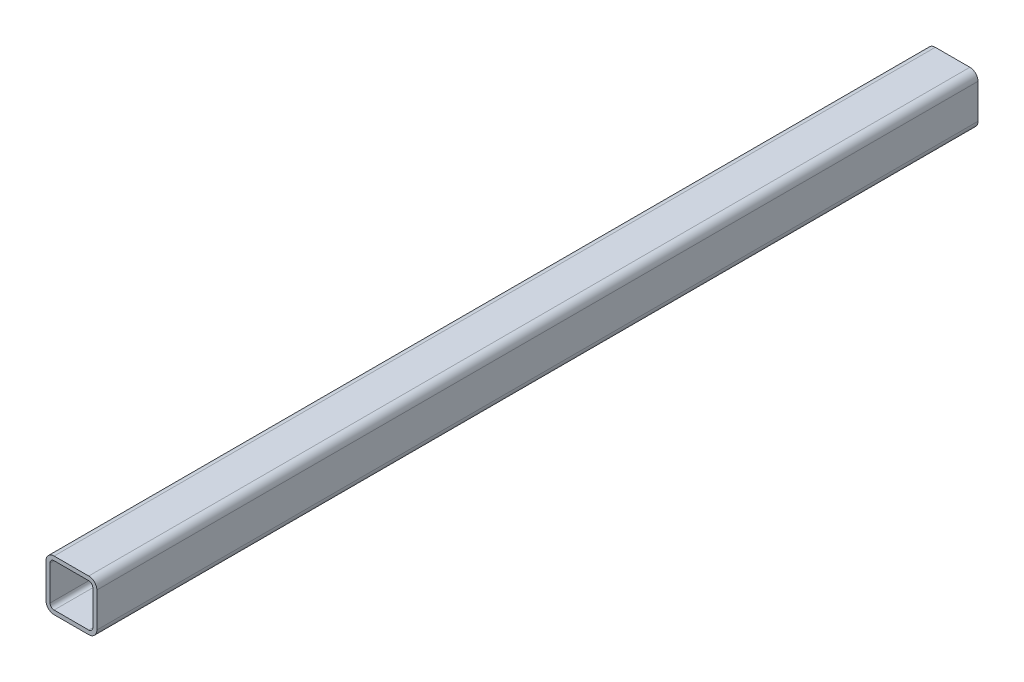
from build123d import *

# Parameters (mm, degrees)
EXTRUDE_THIN1_DEPTH = 330.2


with BuildPart() as part:
    # Sketch1 → Extrude-Thin1 (new, symmetric)
    with BuildSketch(Plane.XY):
        with BuildLine():
            Line((-19.05, -12.97432), (-19.05, 12.97432))
            ThreePointArc((-19.05, 12.97432), (-17.270474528, 17.270474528), (-12.97432, 19.05))
            Line((-12.97432, 19.05), (12.97432, 19.05))
            ThreePointArc((12.97432, 19.05), (17.270474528, 17.270474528), (19.05, 12.97432))
            Line((19.05, 12.97432), (19.05, -12.97432))
            ThreePointArc((19.05, -12.97432), (17.270474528, -17.270474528), (12.97432, -19.05))
            Line((12.97432, -19.05), (-12.97432, -19.05))
            ThreePointArc((-12.97432, -19.05), (-17.270474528, -17.270474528), (-19.05, -12.97432))
        make_face()
        with BuildLine():
            Line((-16.01216, -12.97432), (-16.01216, 12.97432))
            ThreePointArc((-16.01216, 12.97432), (-15.122397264, 15.122397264), (-12.97432, 16.01216))
            Line((-12.97432, 16.01216), (12.97432, 16.01216))
            ThreePointArc((12.97432, 16.01216), (15.122397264, 15.122397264), (16.01216, 12.97432))
            Line((16.01216, 12.97432), (16.01216, -12.97432))
            ThreePointArc((16.01216, -12.97432), (15.122397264, -15.122397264), (12.97432, -16.01216))
            Line((12.97432, -16.01216), (-12.97432, -16.01216))
            ThreePointArc((-12.97432, -16.01216), (-15.122397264, -15.122397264), (-16.01216, -12.97432))
        make_face(mode=Mode.SUBTRACT)
    extrude(amount=EXTRUDE_THIN1_DEPTH, both=True)


solid = part.part
